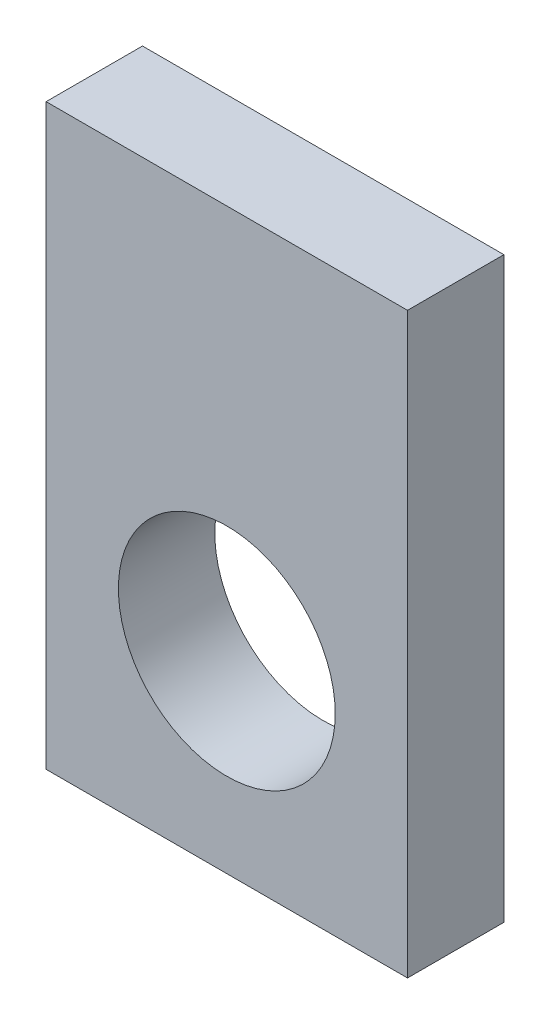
from build123d import *

# Parameters (mm, degrees)
ESQUISSE1_W      = 15
ESQUISSE1_H      = 24
ESQUISSE1_R      = 4.5
EXTRUSION1_DEPTH = 4


with BuildPart() as part:
    # Esquisse1 → Extrusion1 (new body)
    with BuildSketch(Plane.XY):
        with Locations((7.5, 12)):
            Rectangle(ESQUISSE1_W, ESQUISSE1_H)
        with Locations((7.5, 8)):
            Circle(ESQUISSE1_R, mode=Mode.SUBTRACT)
    extrude(amount=EXTRUSION1_DEPTH)


solid = part.part
